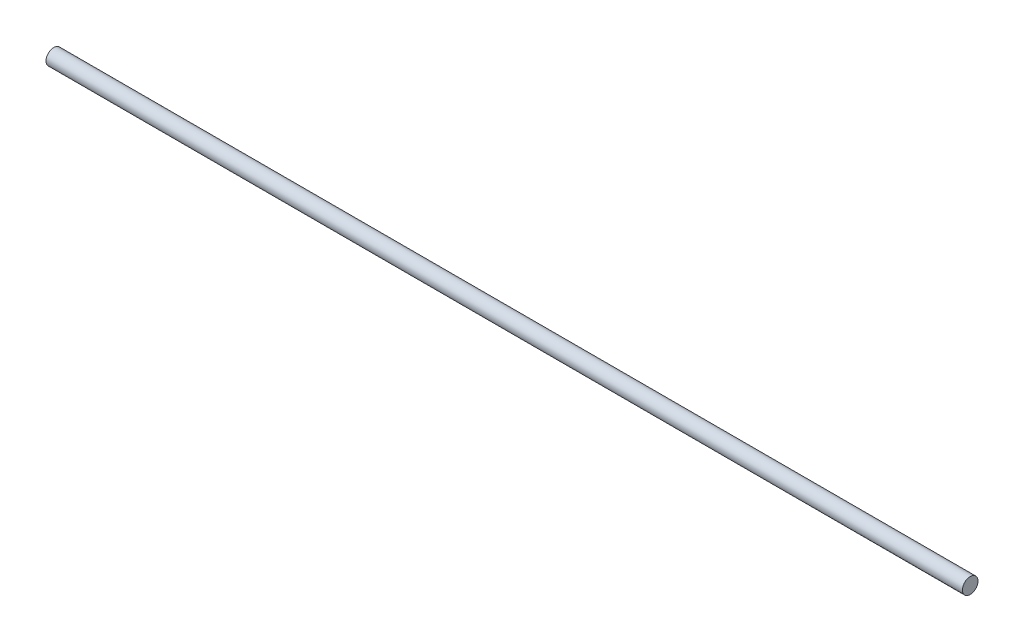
from build123d import *

# Parameters (mm, degrees)
SKIZZE1_R                       = 4
AUFSATZ_LINEAR_AUSTRAGEN1_DEPTH = 235


with BuildPart() as part:
    # Skizze1 → Aufsatz-Linear austragen1 (new, symmetric)
    with BuildSketch(Plane(origin=(0, 0, 0), x_dir=(0, 0, -1), z_dir=(1, 0, 0))):
        with Locations(Location((0, 0, 0), (0, 0, 180))):
            Circle(SKIZZE1_R)
    extrude(amount=AUFSATZ_LINEAR_AUSTRAGEN1_DEPTH, both=True)


solid = part.part
